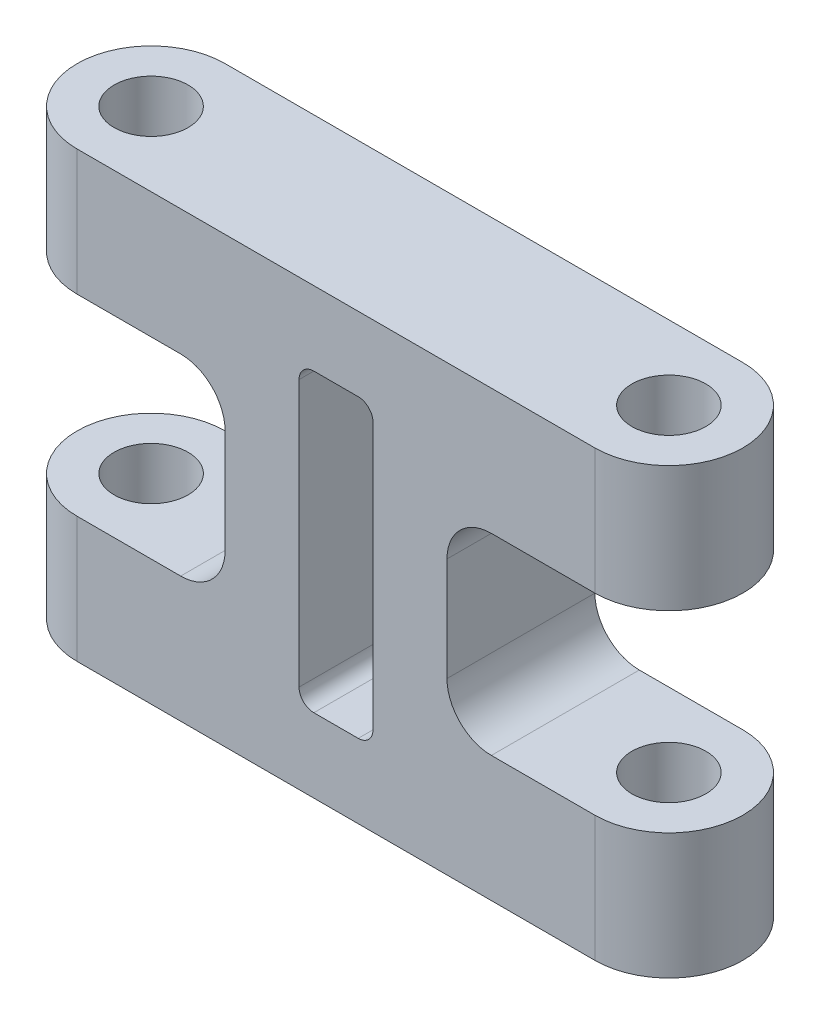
ISO-10303-21;
HEADER;
FILE_DESCRIPTION(('STEP AP214'),'2;1');
FILE_NAME('part.step','',(''),(''),'','','');
FILE_SCHEMA(('AUTOMOTIVE_DESIGN { 1 0 10303 214 1 1 1 1 }'));
ENDSEC;
DATA;
#1=APPLICATION_CONTEXT('core data for automotive mechanical design processes');
#2=APPLICATION_PROTOCOL_DEFINITION('international standard','automotive_design',2000,#1);
#3=PRODUCT_CONTEXT('',#1,'mechanical');
#4=PRODUCT('Part','Part','',(#3));
#5=PRODUCT_RELATED_PRODUCT_CATEGORY('part','',(#4));
#6=PRODUCT_DEFINITION_FORMATION('','',#4);
#7=PRODUCT_DEFINITION_CONTEXT('part definition',#1,'design');
#8=PRODUCT_DEFINITION('design','',#6,#7);
#9=PRODUCT_DEFINITION_SHAPE('','',#8);
#10=(LENGTH_UNIT() NAMED_UNIT(*) SI_UNIT(.MILLI.,.METRE.));
#11=(NAMED_UNIT(*) PLANE_ANGLE_UNIT() SI_UNIT($,.RADIAN.));
#12=(NAMED_UNIT(*) SI_UNIT($,.STERADIAN.) SOLID_ANGLE_UNIT());
#13=UNCERTAINTY_MEASURE_WITH_UNIT(LENGTH_MEASURE(1.E-05),#10,'distance_accuracy_value','');
#14=(GEOMETRIC_REPRESENTATION_CONTEXT(3) GLOBAL_UNCERTAINTY_ASSIGNED_CONTEXT((#13)) GLOBAL_UNIT_ASSIGNED_CONTEXT((#10,
#11,#12)) REPRESENTATION_CONTEXT('',''));
#15=CARTESIAN_POINT('',(0.,0.,0.));
#16=DIRECTION('',(0.,0.,1.));
#17=DIRECTION('',(1.,0.,0.));
#18=AXIS2_PLACEMENT_3D('',#15,#16,#17);
#19=CARTESIAN_POINT('',(-17.5,15.,0.));
#20=DIRECTION('',(0.,-1.,0.));
#21=DIRECTION('',(0.,0.,-1.));
#22=AXIS2_PLACEMENT_3D('',#19,#20,#21);
#23=CYLINDRICAL_SURFACE('',#22,5.);
#24=DIRECTION('',(0.,-1.,0.));
#25=VECTOR('',#24,1.);
#26=CARTESIAN_POINT('',(-17.5,15.,5.));
#27=LINE('',#26,#25);
#28=CARTESIAN_POINT('',(-17.5,-6.50000000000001,5.00000000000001));
#29=VERTEX_POINT('',#28);
#30=CARTESIAN_POINT('',(-17.5,-15.,5.));
#31=VERTEX_POINT('',#30);
#32=EDGE_CURVE('E223',#29,#31,#27,.T.);
#33=ORIENTED_EDGE('',*,*,#32,.F.);
#34=CARTESIAN_POINT('',(-17.5,-6.50000000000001,0.));
#35=DIRECTION('',(0.,-1.,0.));
#36=DIRECTION('',(1.,0.,0.));
#37=AXIS2_PLACEMENT_3D('',#34,#35,#36);
#38=CIRCLE('',#37,5.);
#39=CARTESIAN_POINT('',(-17.5,-6.50000000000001,-5.));
#40=VERTEX_POINT('',#39);
#41=EDGE_CURVE('E338',#29,#40,#38,.T.);
#42=ORIENTED_EDGE('',*,*,#41,.T.);
#43=DIRECTION('',(0.,-1.,0.));
#44=VECTOR('',#43,1.);
#45=CARTESIAN_POINT('',(-17.5,15.,-5.));
#46=LINE('',#45,#44);
#47=CARTESIAN_POINT('',(-17.5,-15.,-5.));
#48=VERTEX_POINT('',#47);
#49=EDGE_CURVE('E352',#40,#48,#46,.T.);
#50=ORIENTED_EDGE('',*,*,#49,.T.);
#51=CARTESIAN_POINT('',(-17.5,-15.,0.));
#52=DIRECTION('',(0.,1.,0.));
#53=DIRECTION('',(0.,0.,1.));
#54=AXIS2_PLACEMENT_3D('',#51,#52,#53);
#55=CIRCLE('',#54,5.);
#56=EDGE_CURVE('E341',#48,#31,#55,.T.);
#57=ORIENTED_EDGE('',*,*,#56,.T.);
#58=EDGE_LOOP('',(#33,#42,#50,#57));
#59=FACE_BOUND('',#58,.T.);
#60=ADVANCED_FACE('F32',(#59),#23,.T.);
#61=CARTESIAN_POINT('',(17.5,15.,0.));
#62=DIRECTION('',(0.,-1.,0.));
#63=DIRECTION('',(0.,0.,-1.));
#64=AXIS2_PLACEMENT_3D('',#61,#62,#63);
#65=CYLINDRICAL_SURFACE('',#64,5.);
#66=DIRECTION('',(0.,-1.,0.));
#67=VECTOR('',#66,1.);
#68=CARTESIAN_POINT('',(17.5,15.,5.));
#69=LINE('',#68,#67);
#70=CARTESIAN_POINT('',(17.5,15.,5.));
#71=VERTEX_POINT('',#70);
#72=CARTESIAN_POINT('',(17.5,6.50000000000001,5.));
#73=VERTEX_POINT('',#72);
#74=EDGE_CURVE('E219',#71,#73,#69,.T.);
#75=ORIENTED_EDGE('',*,*,#74,.T.);
#76=CARTESIAN_POINT('',(17.5,6.5,0.));
#77=DIRECTION('',(0.,1.,0.));
#78=DIRECTION('',(-1.,0.,0.));
#79=AXIS2_PLACEMENT_3D('',#76,#77,#78);
#80=CIRCLE('',#79,5.);
#81=CARTESIAN_POINT('',(17.5,6.50000000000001,-5.00000000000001));
#82=VERTEX_POINT('',#81);
#83=EDGE_CURVE('E202',#73,#82,#80,.T.);
#84=ORIENTED_EDGE('',*,*,#83,.T.);
#85=DIRECTION('',(0.,-1.,0.));
#86=VECTOR('',#85,1.);
#87=CARTESIAN_POINT('',(17.5,15.,-5.00000000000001));
#88=LINE('',#87,#86);
#89=CARTESIAN_POINT('',(17.5,15.,-5.00000000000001));
#90=VERTEX_POINT('',#89);
#91=EDGE_CURVE('E220',#90,#82,#88,.T.);
#92=ORIENTED_EDGE('',*,*,#91,.F.);
#93=CARTESIAN_POINT('',(17.5,15.,0.));
#94=DIRECTION('',(0.,1.,0.));
#95=DIRECTION('',(0.,0.,1.));
#96=AXIS2_PLACEMENT_3D('',#93,#94,#95);
#97=CIRCLE('',#96,5.);
#98=EDGE_CURVE('E348',#71,#90,#97,.T.);
#99=ORIENTED_EDGE('',*,*,#98,.F.);
#100=EDGE_LOOP('',(#75,#84,#92,#99));
#101=FACE_BOUND('',#100,.T.);
#102=ADVANCED_FACE('F388',(#101),#65,.T.);
#103=CARTESIAN_POINT('',(-17.5,6.49999999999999,0.));
#104=DIRECTION('',(0.,1.,0.));
#105=DIRECTION('',(-1.,0.,0.));
#106=AXIS2_PLACEMENT_3D('',#103,#104,#105);
#107=CIRCLE('',#106,5.);
#108=CARTESIAN_POINT('',(-17.5,6.5,-5.));
#109=VERTEX_POINT('',#108);
#110=CARTESIAN_POINT('',(-17.5,6.49999999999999,5.00000000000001));
#111=VERTEX_POINT('',#110);
#112=EDGE_CURVE('E336',#109,#111,#107,.T.);
#113=ORIENTED_EDGE('',*,*,#112,.T.);
#114=CARTESIAN_POINT('',(-17.5,15.,5.));
#115=VERTEX_POINT('',#114);
#116=EDGE_CURVE('E228',#115,#111,#27,.T.);
#117=ORIENTED_EDGE('',*,*,#116,.F.);
#118=CARTESIAN_POINT('',(-17.5,15.,0.));
#119=DIRECTION('',(0.,1.,0.));
#120=DIRECTION('',(0.,0.,1.));
#121=AXIS2_PLACEMENT_3D('',#118,#119,#120);
#122=CIRCLE('',#121,5.);
#123=CARTESIAN_POINT('',(-17.5,15.,-5.));
#124=VERTEX_POINT('',#123);
#125=EDGE_CURVE('E342',#124,#115,#122,.T.);
#126=ORIENTED_EDGE('',*,*,#125,.F.);
#127=EDGE_CURVE('E359',#124,#109,#46,.T.);
#128=ORIENTED_EDGE('',*,*,#127,.T.);
#129=EDGE_LOOP('',(#113,#117,#126,#128));
#130=FACE_BOUND('',#129,.T.);
#131=ADVANCED_FACE('F390',(#130),#23,.T.);
#132=CARTESIAN_POINT('',(-17.5,15.,5.));
#133=DIRECTION('',(0.,0.,-1.));
#134=DIRECTION('',(-1.,0.,0.));
#135=AXIS2_PLACEMENT_3D('',#132,#133,#134);
#136=PLANE('',#135);
#137=DIRECTION('',(-1.,0.,0.));
#138=VECTOR('',#137,1.);
#139=CARTESIAN_POINT('',(-2.5,10.,5.));
#140=LINE('',#139,#138);
#141=CARTESIAN_POINT('',(1.5,10.,5.));
#142=VERTEX_POINT('',#141);
#143=CARTESIAN_POINT('',(-1.5,10.,5.));
#144=VERTEX_POINT('',#143);
#145=EDGE_CURVE('E497',#142,#144,#140,.T.);
#146=ORIENTED_EDGE('',*,*,#145,.F.);
#147=CARTESIAN_POINT('',(1.5,9.,5.));
#148=DIRECTION('',(0.,0.,-1.));
#149=DIRECTION('',(-1.,0.,0.));
#150=AXIS2_PLACEMENT_3D('',#147,#148,#149);
#151=CIRCLE('',#150,1.);
#152=CARTESIAN_POINT('',(2.5,9.,5.));
#153=VERTEX_POINT('',#152);
#154=EDGE_CURVE('E264',#142,#153,#151,.T.);
#155=ORIENTED_EDGE('',*,*,#154,.T.);
#156=DIRECTION('',(0.,1.,0.));
#157=VECTOR('',#156,1.);
#158=CARTESIAN_POINT('',(2.5,-10.,5.));
#159=LINE('',#158,#157);
#160=CARTESIAN_POINT('',(2.5,-9.,5.));
#161=VERTEX_POINT('',#160);
#162=EDGE_CURVE('E494',#161,#153,#159,.T.);
#163=ORIENTED_EDGE('',*,*,#162,.F.);
#164=CARTESIAN_POINT('',(1.5,-9.,5.));
#165=DIRECTION('',(0.,0.,-1.));
#166=DIRECTION('',(-1.,0.,0.));
#167=AXIS2_PLACEMENT_3D('',#164,#165,#166);
#168=CIRCLE('',#167,1.);
#169=CARTESIAN_POINT('',(1.5,-10.,5.));
#170=VERTEX_POINT('',#169);
#171=EDGE_CURVE('E272',#161,#170,#168,.T.);
#172=ORIENTED_EDGE('',*,*,#171,.T.);
#173=DIRECTION('',(1.,0.,0.));
#174=VECTOR('',#173,1.);
#175=CARTESIAN_POINT('',(-2.5,-10.,5.));
#176=LINE('',#175,#174);
#177=CARTESIAN_POINT('',(-1.5,-10.,5.));
#178=VERTEX_POINT('',#177);
#179=EDGE_CURVE('E488',#178,#170,#176,.T.);
#180=ORIENTED_EDGE('',*,*,#179,.F.);
#181=CARTESIAN_POINT('',(-1.5,-9.,5.));
#182=DIRECTION('',(0.,0.,-1.));
#183=DIRECTION('',(-1.,0.,0.));
#184=AXIS2_PLACEMENT_3D('',#181,#182,#183);
#185=CIRCLE('',#184,1.);
#186=CARTESIAN_POINT('',(-2.5,-9.,5.));
#187=VERTEX_POINT('',#186);
#188=EDGE_CURVE('E276',#178,#187,#185,.T.);
#189=ORIENTED_EDGE('',*,*,#188,.T.);
#190=DIRECTION('',(0.,-1.,0.));
#191=VECTOR('',#190,1.);
#192=CARTESIAN_POINT('',(-2.5,-10.,5.));
#193=LINE('',#192,#191);
#194=CARTESIAN_POINT('',(-2.5,9.,5.));
#195=VERTEX_POINT('',#194);
#196=EDGE_CURVE('E499',#195,#187,#193,.T.);
#197=ORIENTED_EDGE('',*,*,#196,.F.);
#198=CARTESIAN_POINT('',(-1.5,9.,5.));
#199=DIRECTION('',(0.,0.,-1.));
#200=DIRECTION('',(-1.,0.,0.));
#201=AXIS2_PLACEMENT_3D('',#198,#199,#200);
#202=CIRCLE('',#201,1.);
#203=EDGE_CURVE('E268',#195,#144,#202,.T.);
#204=ORIENTED_EDGE('',*,*,#203,.T.);
#205=EDGE_LOOP('',(#146,#155,#163,#172,#180,#189,#197,#204));
#206=FACE_BOUND('',#205,.T.);
#207=DIRECTION('',(1.,0.,0.));
#208=VECTOR('',#207,1.);
#209=CARTESIAN_POINT('',(-22.5,6.49999999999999,5.00000000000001));
#210=LINE('',#209,#208);
#211=CARTESIAN_POINT('',(-10.5,6.5,5.00000000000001));
#212=VERTEX_POINT('',#211);
#213=EDGE_CURVE('E408',#111,#212,#210,.T.);
#214=ORIENTED_EDGE('',*,*,#213,.T.);
#215=CARTESIAN_POINT('',(-10.5,3.49999999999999,5.));
#216=DIRECTION('',(0.,0.,-1.));
#217=DIRECTION('',(-1.,0.,0.));
#218=AXIS2_PLACEMENT_3D('',#215,#216,#217);
#219=CIRCLE('',#218,3.);
#220=CARTESIAN_POINT('',(-7.5,3.49999999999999,5.00000000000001));
#221=VERTEX_POINT('',#220);
#222=EDGE_CURVE('E308',#212,#221,#219,.T.);
#223=ORIENTED_EDGE('',*,*,#222,.T.);
#224=DIRECTION('',(0.,-1.,0.));
#225=VECTOR('',#224,1.);
#226=CARTESIAN_POINT('',(-7.5,-6.5,5.00000000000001));
#227=LINE('',#226,#225);
#228=CARTESIAN_POINT('',(-7.5,-3.5,5.00000000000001));
#229=VERTEX_POINT('',#228);
#230=EDGE_CURVE('E412',#221,#229,#227,.T.);
#231=ORIENTED_EDGE('',*,*,#230,.T.);
#232=CARTESIAN_POINT('',(-10.5,-3.5,5.));
#233=DIRECTION('',(0.,0.,-1.));
#234=DIRECTION('',(-1.,0.,0.));
#235=AXIS2_PLACEMENT_3D('',#232,#233,#234);
#236=CIRCLE('',#235,3.);
#237=CARTESIAN_POINT('',(-10.5,-6.5,5.00000000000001));
#238=VERTEX_POINT('',#237);
#239=EDGE_CURVE('E304',#229,#238,#236,.T.);
#240=ORIENTED_EDGE('',*,*,#239,.T.);
#241=DIRECTION('',(-1.,0.,0.));
#242=VECTOR('',#241,1.);
#243=CARTESIAN_POINT('',(-22.5,-6.50000000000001,5.00000000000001));
#244=LINE('',#243,#242);
#245=EDGE_CURVE('E203',#238,#29,#244,.T.);
#246=ORIENTED_EDGE('',*,*,#245,.T.);
#247=ORIENTED_EDGE('',*,*,#32,.T.);
#248=DIRECTION('',(1.,0.,0.));
#249=VECTOR('',#248,1.);
#250=CARTESIAN_POINT('',(-17.5,-15.,5.));
#251=LINE('',#250,#249);
#252=CARTESIAN_POINT('',(17.5,-15.,5.));
#253=VERTEX_POINT('',#252);
#254=EDGE_CURVE('E217',#31,#253,#251,.T.);
#255=ORIENTED_EDGE('',*,*,#254,.T.);
#256=CARTESIAN_POINT('',(17.5,-6.49999999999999,5.));
#257=VERTEX_POINT('',#256);
#258=EDGE_CURVE('E197',#257,#253,#69,.T.);
#259=ORIENTED_EDGE('',*,*,#258,.F.);
#260=DIRECTION('',(-1.,0.,0.));
#261=VECTOR('',#260,1.);
#262=CARTESIAN_POINT('',(22.5,-6.49999999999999,5.));
#263=LINE('',#262,#261);
#264=CARTESIAN_POINT('',(10.5,-6.5,5.));
#265=VERTEX_POINT('',#264);
#266=EDGE_CURVE('E206',#257,#265,#263,.T.);
#267=ORIENTED_EDGE('',*,*,#266,.T.);
#268=CARTESIAN_POINT('',(10.5,-3.5,5.));
#269=DIRECTION('',(0.,0.,-1.));
#270=DIRECTION('',(-1.,0.,0.));
#271=AXIS2_PLACEMENT_3D('',#268,#269,#270);
#272=CIRCLE('',#271,3.);
#273=CARTESIAN_POINT('',(7.5,-3.5,5.));
#274=VERTEX_POINT('',#273);
#275=EDGE_CURVE('E300',#265,#274,#272,.T.);
#276=ORIENTED_EDGE('',*,*,#275,.T.);
#277=DIRECTION('',(0.,1.,0.));
#278=VECTOR('',#277,1.);
#279=CARTESIAN_POINT('',(7.5,-6.5,5.));
#280=LINE('',#279,#278);
#281=CARTESIAN_POINT('',(7.5,3.5,5.00000000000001));
#282=VERTEX_POINT('',#281);
#283=EDGE_CURVE('E211',#274,#282,#280,.T.);
#284=ORIENTED_EDGE('',*,*,#283,.T.);
#285=CARTESIAN_POINT('',(10.5,3.5,5.));
#286=DIRECTION('',(0.,0.,-1.));
#287=DIRECTION('',(-1.,0.,0.));
#288=AXIS2_PLACEMENT_3D('',#285,#286,#287);
#289=CIRCLE('',#288,3.);
#290=CARTESIAN_POINT('',(10.5,6.5,5.));
#291=VERTEX_POINT('',#290);
#292=EDGE_CURVE('E11',#282,#291,#289,.T.);
#293=ORIENTED_EDGE('',*,*,#292,.T.);
#294=DIRECTION('',(1.,0.,0.));
#295=VECTOR('',#294,1.);
#296=CARTESIAN_POINT('',(22.5,6.50000000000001,5.));
#297=LINE('',#296,#295);
#298=EDGE_CURVE('E325',#291,#73,#297,.T.);
#299=ORIENTED_EDGE('',*,*,#298,.T.);
#300=ORIENTED_EDGE('',*,*,#74,.F.);
#301=DIRECTION('',(1.,0.,0.));
#302=VECTOR('',#301,1.);
#303=CARTESIAN_POINT('',(-17.5,15.,5.));
#304=LINE('',#303,#302);
#305=EDGE_CURVE('E345',#115,#71,#304,.T.);
#306=ORIENTED_EDGE('',*,*,#305,.F.);
#307=ORIENTED_EDGE('',*,*,#116,.T.);
#308=EDGE_LOOP('',(#214,#223,#231,#240,#246,#247,#255,#259,#267,#276,#284,#293,#299,#300,#306,#307));
#309=FACE_BOUND('',#308,.T.);
#310=ADVANCED_FACE('F215',(#206,#309),#136,.F.);
#311=CARTESIAN_POINT('',(17.5,-6.5,0.));
#312=DIRECTION('',(0.,-1.,0.));
#313=DIRECTION('',(1.,0.,0.));
#314=AXIS2_PLACEMENT_3D('',#311,#312,#313);
#315=CIRCLE('',#314,5.);
#316=CARTESIAN_POINT('',(17.5,-6.5,-5.00000000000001));
#317=VERTEX_POINT('',#316);
#318=EDGE_CURVE('E192',#317,#257,#315,.T.);
#319=ORIENTED_EDGE('',*,*,#318,.T.);
#320=ORIENTED_EDGE('',*,*,#258,.T.);
#321=CARTESIAN_POINT('',(17.5,-15.,0.));
#322=DIRECTION('',(0.,1.,0.));
#323=DIRECTION('',(0.,0.,1.));
#324=AXIS2_PLACEMENT_3D('',#321,#322,#323);
#325=CIRCLE('',#324,5.);
#326=CARTESIAN_POINT('',(17.5,-15.,-5.00000000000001));
#327=VERTEX_POINT('',#326);
#328=EDGE_CURVE('E356',#253,#327,#325,.T.);
#329=ORIENTED_EDGE('',*,*,#328,.T.);
#330=EDGE_CURVE('E199',#317,#327,#88,.T.);
#331=ORIENTED_EDGE('',*,*,#330,.F.);
#332=EDGE_LOOP('',(#319,#320,#329,#331));
#333=FACE_BOUND('',#332,.T.);
#334=ADVANCED_FACE('F194',(#333),#65,.T.);
#335=CARTESIAN_POINT('',(-17.5,15.,-5.));
#336=DIRECTION('',(0.,0.,1.));
#337=DIRECTION('',(1.,0.,0.));
#338=AXIS2_PLACEMENT_3D('',#335,#336,#337);
#339=PLANE('',#338);
#340=DIRECTION('',(0.,-1.,0.));
#341=VECTOR('',#340,1.);
#342=CARTESIAN_POINT('',(-2.5,-10.,-5.00000000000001));
#343=LINE('',#342,#341);
#344=CARTESIAN_POINT('',(-2.5,9.,-5.00000000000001));
#345=VERTEX_POINT('',#344);
#346=CARTESIAN_POINT('',(-2.5,-9.,-5.00000000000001));
#347=VERTEX_POINT('',#346);
#348=EDGE_CURVE('E484',#345,#347,#343,.T.);
#349=ORIENTED_EDGE('',*,*,#348,.T.);
#350=CARTESIAN_POINT('',(-1.5,-9.,-5.));
#351=DIRECTION('',(0.,0.,1.));
#352=DIRECTION('',(1.,0.,0.));
#353=AXIS2_PLACEMENT_3D('',#350,#351,#352);
#354=CIRCLE('',#353,1.);
#355=CARTESIAN_POINT('',(-1.5,-10.,-5.00000000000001));
#356=VERTEX_POINT('',#355);
#357=EDGE_CURVE('E278',#347,#356,#354,.T.);
#358=ORIENTED_EDGE('',*,*,#357,.T.);
#359=DIRECTION('',(1.,0.,0.));
#360=VECTOR('',#359,1.);
#361=CARTESIAN_POINT('',(-2.5,-10.,-5.00000000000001));
#362=LINE('',#361,#360);
#363=CARTESIAN_POINT('',(1.5,-10.,-5.00000000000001));
#364=VERTEX_POINT('',#363);
#365=EDGE_CURVE('E486',#356,#364,#362,.T.);
#366=ORIENTED_EDGE('',*,*,#365,.T.);
#367=CARTESIAN_POINT('',(1.5,-9.,-5.));
#368=DIRECTION('',(0.,0.,1.));
#369=DIRECTION('',(1.,0.,0.));
#370=AXIS2_PLACEMENT_3D('',#367,#368,#369);
#371=CIRCLE('',#370,1.);
#372=CARTESIAN_POINT('',(2.5,-9.,-5.00000000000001));
#373=VERTEX_POINT('',#372);
#374=EDGE_CURVE('E274',#364,#373,#371,.T.);
#375=ORIENTED_EDGE('',*,*,#374,.T.);
#376=DIRECTION('',(0.,1.,0.));
#377=VECTOR('',#376,1.);
#378=CARTESIAN_POINT('',(2.5,-10.,-5.00000000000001));
#379=LINE('',#378,#377);
#380=CARTESIAN_POINT('',(2.5,9.,-5.00000000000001));
#381=VERTEX_POINT('',#380);
#382=EDGE_CURVE('E480',#373,#381,#379,.T.);
#383=ORIENTED_EDGE('',*,*,#382,.T.);
#384=CARTESIAN_POINT('',(1.5,9.,-5.));
#385=DIRECTION('',(0.,0.,1.));
#386=DIRECTION('',(1.,0.,0.));
#387=AXIS2_PLACEMENT_3D('',#384,#385,#386);
#388=CIRCLE('',#387,1.);
#389=CARTESIAN_POINT('',(1.5,10.,-5.00000000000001));
#390=VERTEX_POINT('',#389);
#391=EDGE_CURVE('E266',#381,#390,#388,.T.);
#392=ORIENTED_EDGE('',*,*,#391,.T.);
#393=DIRECTION('',(-1.,0.,0.));
#394=VECTOR('',#393,1.);
#395=CARTESIAN_POINT('',(-2.5,10.,-5.00000000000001));
#396=LINE('',#395,#394);
#397=CARTESIAN_POINT('',(-1.5,10.,-5.00000000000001));
#398=VERTEX_POINT('',#397);
#399=EDGE_CURVE('E477',#390,#398,#396,.T.);
#400=ORIENTED_EDGE('',*,*,#399,.T.);
#401=CARTESIAN_POINT('',(-1.5,9.,-5.));
#402=DIRECTION('',(0.,0.,1.));
#403=DIRECTION('',(1.,0.,0.));
#404=AXIS2_PLACEMENT_3D('',#401,#402,#403);
#405=CIRCLE('',#404,1.);
#406=EDGE_CURVE('E270',#398,#345,#405,.T.);
#407=ORIENTED_EDGE('',*,*,#406,.T.);
#408=EDGE_LOOP('',(#349,#358,#366,#375,#383,#392,#400,#407));
#409=FACE_BOUND('',#408,.T.);
#410=ORIENTED_EDGE('',*,*,#49,.F.);
#411=DIRECTION('',(-1.,0.,0.));
#412=VECTOR('',#411,1.);
#413=CARTESIAN_POINT('',(-22.5,-6.50000000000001,-5.));
#414=LINE('',#413,#412);
#415=CARTESIAN_POINT('',(-10.5,-6.5,-5.));
#416=VERTEX_POINT('',#415);
#417=EDGE_CURVE('E330',#416,#40,#414,.T.);
#418=ORIENTED_EDGE('',*,*,#417,.F.);
#419=CARTESIAN_POINT('',(-10.5,-3.5,-5.));
#420=DIRECTION('',(0.,0.,1.));
#421=DIRECTION('',(1.,0.,0.));
#422=AXIS2_PLACEMENT_3D('',#419,#420,#421);
#423=CIRCLE('',#422,3.);
#424=CARTESIAN_POINT('',(-7.5,-3.5,-5.));
#425=VERTEX_POINT('',#424);
#426=EDGE_CURVE('E302',#416,#425,#423,.T.);
#427=ORIENTED_EDGE('',*,*,#426,.T.);
#428=DIRECTION('',(0.,-1.,0.));
#429=VECTOR('',#428,1.);
#430=CARTESIAN_POINT('',(-7.5,-6.5,-5.));
#431=LINE('',#430,#429);
#432=CARTESIAN_POINT('',(-7.5,3.49999999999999,-5.));
#433=VERTEX_POINT('',#432);
#434=EDGE_CURVE('E327',#433,#425,#431,.T.);
#435=ORIENTED_EDGE('',*,*,#434,.F.);
#436=CARTESIAN_POINT('',(-10.5,3.49999999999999,-5.));
#437=DIRECTION('',(0.,0.,1.));
#438=DIRECTION('',(1.,0.,0.));
#439=AXIS2_PLACEMENT_3D('',#436,#437,#438);
#440=CIRCLE('',#439,3.);
#441=CARTESIAN_POINT('',(-10.5,6.5,-5.));
#442=VERTEX_POINT('',#441);
#443=EDGE_CURVE('E306',#433,#442,#440,.T.);
#444=ORIENTED_EDGE('',*,*,#443,.T.);
#445=DIRECTION('',(-1.,0.,0.));
#446=VECTOR('',#445,1.);
#447=CARTESIAN_POINT('',(-17.5,6.49999999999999,-5.));
#448=LINE('',#447,#446);
#449=EDGE_CURVE('E233',#442,#109,#448,.T.);
#450=ORIENTED_EDGE('',*,*,#449,.T.);
#451=ORIENTED_EDGE('',*,*,#127,.F.);
#452=DIRECTION('',(-1.,0.,0.));
#453=VECTOR('',#452,1.);
#454=CARTESIAN_POINT('',(-17.5,15.,-5.));
#455=LINE('',#454,#453);
#456=EDGE_CURVE('E350',#90,#124,#455,.T.);
#457=ORIENTED_EDGE('',*,*,#456,.F.);
#458=ORIENTED_EDGE('',*,*,#91,.T.);
#459=DIRECTION('',(1.,0.,0.));
#460=VECTOR('',#459,1.);
#461=CARTESIAN_POINT('',(22.5,6.50000000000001,-5.00000000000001));
#462=LINE('',#461,#460);
#463=CARTESIAN_POINT('',(10.5,6.5,-5.00000000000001));
#464=VERTEX_POINT('',#463);
#465=EDGE_CURVE('E212',#464,#82,#462,.T.);
#466=ORIENTED_EDGE('',*,*,#465,.F.);
#467=CARTESIAN_POINT('',(10.5,3.5,-5.00000000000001));
#468=DIRECTION('',(0.,0.,1.));
#469=DIRECTION('',(1.,0.,0.));
#470=AXIS2_PLACEMENT_3D('',#467,#468,#469);
#471=CIRCLE('',#470,3.);
#472=CARTESIAN_POINT('',(7.5,3.5,-5.00000000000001));
#473=VERTEX_POINT('',#472);
#474=EDGE_CURVE('E40',#464,#473,#471,.T.);
#475=ORIENTED_EDGE('',*,*,#474,.T.);
#476=DIRECTION('',(0.,1.,0.));
#477=VECTOR('',#476,1.);
#478=CARTESIAN_POINT('',(7.5,-6.5,-5.00000000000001));
#479=LINE('',#478,#477);
#480=CARTESIAN_POINT('',(7.5,-3.5,-5.00000000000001));
#481=VERTEX_POINT('',#480);
#482=EDGE_CURVE('E315',#481,#473,#479,.T.);
#483=ORIENTED_EDGE('',*,*,#482,.F.);
#484=CARTESIAN_POINT('',(10.5,-3.5,-5.00000000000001));
#485=DIRECTION('',(0.,0.,1.));
#486=DIRECTION('',(1.,0.,0.));
#487=AXIS2_PLACEMENT_3D('',#484,#485,#486);
#488=CIRCLE('',#487,3.);
#489=CARTESIAN_POINT('',(10.5,-6.5,-5.00000000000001));
#490=VERTEX_POINT('',#489);
#491=EDGE_CURVE('E298',#481,#490,#488,.T.);
#492=ORIENTED_EDGE('',*,*,#491,.T.);
#493=DIRECTION('',(1.,0.,0.));
#494=VECTOR('',#493,1.);
#495=CARTESIAN_POINT('',(-17.5,-6.50000000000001,-5.));
#496=LINE('',#495,#494);
#497=EDGE_CURVE('E231',#490,#317,#496,.T.);
#498=ORIENTED_EDGE('',*,*,#497,.T.);
#499=ORIENTED_EDGE('',*,*,#330,.T.);
#500=DIRECTION('',(-1.,0.,0.));
#501=VECTOR('',#500,1.);
#502=CARTESIAN_POINT('',(-17.5,-15.,-5.));
#503=LINE('',#502,#501);
#504=EDGE_CURVE('E346',#327,#48,#503,.T.);
#505=ORIENTED_EDGE('',*,*,#504,.T.);
#506=EDGE_LOOP('',(#410,#418,#427,#435,#444,#450,#451,#457,#458,#466,#475,#483,#492,#498,#499,#505));
#507=FACE_BOUND('',#506,.T.);
#508=ADVANCED_FACE('F314',(#409,#507),#339,.F.);
#509=CARTESIAN_POINT('',(-17.5,15.,0.));
#510=DIRECTION('',(0.,1.,0.));
#511=DIRECTION('',(0.,0.,1.));
#512=AXIS2_PLACEMENT_3D('',#509,#510,#511);
#513=PLANE('',#512);
#514=CARTESIAN_POINT('',(-17.5,15.,0.));
#515=DIRECTION('',(0.,1.,0.));
#516=DIRECTION('',(0.,0.,1.));
#517=AXIS2_PLACEMENT_3D('',#514,#515,#516);
#518=CIRCLE('',#517,2.5);
#519=CARTESIAN_POINT('',(-17.5,15.,2.5));
#520=VERTEX_POINT('',#519);
#521=EDGE_CURVE('E505',#520,#520,#518,.T.);
#522=ORIENTED_EDGE('',*,*,#521,.F.);
#523=EDGE_LOOP('',(#522));
#524=FACE_BOUND('',#523,.T.);
#525=CARTESIAN_POINT('',(17.5,15.,0.));
#526=DIRECTION('',(0.,1.,0.));
#527=DIRECTION('',(0.,0.,1.));
#528=AXIS2_PLACEMENT_3D('',#525,#526,#527);
#529=CIRCLE('',#528,2.5);
#530=CARTESIAN_POINT('',(17.5,15.,2.5));
#531=VERTEX_POINT('',#530);
#532=EDGE_CURVE('E493',#531,#531,#529,.T.);
#533=ORIENTED_EDGE('',*,*,#532,.F.);
#534=EDGE_LOOP('',(#533));
#535=FACE_BOUND('',#534,.T.);
#536=ORIENTED_EDGE('',*,*,#125,.T.);
#537=ORIENTED_EDGE('',*,*,#305,.T.);
#538=ORIENTED_EDGE('',*,*,#98,.T.);
#539=ORIENTED_EDGE('',*,*,#456,.T.);
#540=EDGE_LOOP('',(#536,#537,#538,#539));
#541=FACE_BOUND('',#540,.T.);
#542=ADVANCED_FACE('F373',(#524,#535,#541),#513,.T.);
#543=CARTESIAN_POINT('',(-17.5,-15.,0.));
#544=DIRECTION('',(0.,1.,0.));
#545=DIRECTION('',(0.,0.,1.));
#546=AXIS2_PLACEMENT_3D('',#543,#544,#545);
#547=PLANE('',#546);
#548=CARTESIAN_POINT('',(-17.5,-15.,0.));
#549=DIRECTION('',(0.,1.,0.));
#550=DIRECTION('',(0.,0.,1.));
#551=AXIS2_PLACEMENT_3D('',#548,#549,#550);
#552=CIRCLE('',#551,2.5);
#553=CARTESIAN_POINT('',(-17.5,-15.,2.5));
#554=VERTEX_POINT('',#553);
#555=EDGE_CURVE('E240',#554,#554,#552,.T.);
#556=ORIENTED_EDGE('',*,*,#555,.T.);
#557=EDGE_LOOP('',(#556));
#558=FACE_BOUND('',#557,.T.);
#559=CARTESIAN_POINT('',(17.5,-15.,0.));
#560=DIRECTION('',(0.,1.,0.));
#561=DIRECTION('',(0.,0.,1.));
#562=AXIS2_PLACEMENT_3D('',#559,#560,#561);
#563=CIRCLE('',#562,2.5);
#564=CARTESIAN_POINT('',(17.5,-15.,2.5));
#565=VERTEX_POINT('',#564);
#566=EDGE_CURVE('E508',#565,#565,#563,.T.);
#567=ORIENTED_EDGE('',*,*,#566,.T.);
#568=EDGE_LOOP('',(#567));
#569=FACE_BOUND('',#568,.T.);
#570=ORIENTED_EDGE('',*,*,#56,.F.);
#571=ORIENTED_EDGE('',*,*,#504,.F.);
#572=ORIENTED_EDGE('',*,*,#328,.F.);
#573=ORIENTED_EDGE('',*,*,#254,.F.);
#574=EDGE_LOOP('',(#570,#571,#572,#573));
#575=FACE_BOUND('',#574,.T.);
#576=ADVANCED_FACE('F371',(#558,#569,#575),#547,.F.);
#577=CARTESIAN_POINT('',(22.5,6.50000000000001,5.));
#578=DIRECTION('',(0.,1.,0.));
#579=DIRECTION('',(-1.,0.,0.));
#580=AXIS2_PLACEMENT_3D('',#577,#578,#579);
#581=PLANE('',#580);
#582=CARTESIAN_POINT('',(17.5,6.50000000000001,0.));
#583=DIRECTION('',(0.,1.,0.));
#584=DIRECTION('',(-1.,0.,0.));
#585=AXIS2_PLACEMENT_3D('',#582,#583,#584);
#586=CIRCLE('',#585,2.5);
#587=CARTESIAN_POINT('',(15.,6.50000000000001,0.));
#588=VERTEX_POINT('',#587);
#589=EDGE_CURVE('E244',#588,#588,#586,.T.);
#590=ORIENTED_EDGE('',*,*,#589,.T.);
#591=EDGE_LOOP('',(#590));
#592=FACE_BOUND('',#591,.T.);
#593=ORIENTED_EDGE('',*,*,#298,.F.);
#594=DIRECTION('',(0.,0.,-1.));
#595=VECTOR('',#594,1.);
#596=CARTESIAN_POINT('',(10.5,6.5,-5.));
#597=LINE('',#596,#595);
#598=EDGE_CURVE('E296',#291,#464,#597,.T.);
#599=ORIENTED_EDGE('',*,*,#598,.T.);
#600=ORIENTED_EDGE('',*,*,#465,.T.);
#601=ORIENTED_EDGE('',*,*,#83,.F.);
#602=EDGE_LOOP('',(#593,#599,#600,#601));
#603=FACE_BOUND('',#602,.T.);
#604=ADVANCED_FACE('F322',(#592,#603),#581,.F.);
#605=CARTESIAN_POINT('',(22.5,-6.49999999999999,5.));
#606=DIRECTION('',(0.,-1.,0.));
#607=DIRECTION('',(1.,0.,0.));
#608=AXIS2_PLACEMENT_3D('',#605,#606,#607);
#609=PLANE('',#608);
#610=CARTESIAN_POINT('',(17.5,-6.49999999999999,0.));
#611=DIRECTION('',(0.,-1.,0.));
#612=DIRECTION('',(1.,0.,0.));
#613=AXIS2_PLACEMENT_3D('',#610,#611,#612);
#614=CIRCLE('',#613,2.5);
#615=CARTESIAN_POINT('',(20.,-6.49999999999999,0.));
#616=VERTEX_POINT('',#615);
#617=EDGE_CURVE('E241',#616,#616,#614,.T.);
#618=ORIENTED_EDGE('',*,*,#617,.T.);
#619=EDGE_LOOP('',(#618));
#620=FACE_BOUND('',#619,.T.);
#621=ORIENTED_EDGE('',*,*,#497,.F.);
#622=DIRECTION('',(0.,0.,-1.));
#623=VECTOR('',#622,1.);
#624=CARTESIAN_POINT('',(10.5,-6.5,5.));
#625=LINE('',#624,#623);
#626=EDGE_CURVE('E209',#490,#265,#625,.F.);
#627=ORIENTED_EDGE('',*,*,#626,.T.);
#628=ORIENTED_EDGE('',*,*,#266,.F.);
#629=ORIENTED_EDGE('',*,*,#318,.F.);
#630=EDGE_LOOP('',(#621,#627,#628,#629));
#631=FACE_BOUND('',#630,.T.);
#632=ADVANCED_FACE('F207',(#620,#631),#609,.F.);
#633=CARTESIAN_POINT('',(7.5,-6.5,5.));
#634=DIRECTION('',(-1.,0.,0.));
#635=DIRECTION('',(0.,-1.,0.));
#636=AXIS2_PLACEMENT_3D('',#633,#634,#635);
#637=PLANE('',#636);
#638=ORIENTED_EDGE('',*,*,#283,.F.);
#639=DIRECTION('',(0.,0.,-1.));
#640=VECTOR('',#639,1.);
#641=CARTESIAN_POINT('',(7.5,-3.5,-5.));
#642=LINE('',#641,#640);
#643=EDGE_CURVE('E282',#274,#481,#642,.T.);
#644=ORIENTED_EDGE('',*,*,#643,.T.);
#645=ORIENTED_EDGE('',*,*,#482,.T.);
#646=DIRECTION('',(0.,0.,-1.));
#647=VECTOR('',#646,1.);
#648=CARTESIAN_POINT('',(7.5,3.5,5.00000000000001));
#649=LINE('',#648,#647);
#650=EDGE_CURVE('E280',#473,#282,#649,.F.);
#651=ORIENTED_EDGE('',*,*,#650,.T.);
#652=EDGE_LOOP('',(#638,#644,#645,#651));
#653=FACE_BOUND('',#652,.T.);
#654=ADVANCED_FACE('F318',(#653),#637,.F.);
#655=CARTESIAN_POINT('',(-22.5,-6.50000000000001,5.00000000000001));
#656=DIRECTION('',(0.,-1.,0.));
#657=DIRECTION('',(1.,0.,0.));
#658=AXIS2_PLACEMENT_3D('',#655,#656,#657);
#659=PLANE('',#658);
#660=CARTESIAN_POINT('',(-17.5,-6.50000000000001,0.));
#661=DIRECTION('',(0.,-1.,0.));
#662=DIRECTION('',(1.,0.,0.));
#663=AXIS2_PLACEMENT_3D('',#660,#661,#662);
#664=CIRCLE('',#663,2.5);
#665=CARTESIAN_POINT('',(-15.,-6.50000000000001,0.));
#666=VERTEX_POINT('',#665);
#667=EDGE_CURVE('E239',#666,#666,#664,.T.);
#668=ORIENTED_EDGE('',*,*,#667,.T.);
#669=EDGE_LOOP('',(#668));
#670=FACE_BOUND('',#669,.T.);
#671=ORIENTED_EDGE('',*,*,#245,.F.);
#672=DIRECTION('',(0.,0.,-1.));
#673=VECTOR('',#672,1.);
#674=CARTESIAN_POINT('',(-10.5,-6.5,-5.));
#675=LINE('',#674,#673);
#676=EDGE_CURVE('E286',#238,#416,#675,.T.);
#677=ORIENTED_EDGE('',*,*,#676,.T.);
#678=ORIENTED_EDGE('',*,*,#417,.T.);
#679=ORIENTED_EDGE('',*,*,#41,.F.);
#680=EDGE_LOOP('',(#671,#677,#678,#679));
#681=FACE_BOUND('',#680,.T.);
#682=ADVANCED_FACE('F434',(#670,#681),#659,.F.);
#683=CARTESIAN_POINT('',(-22.5,6.49999999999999,5.00000000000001));
#684=DIRECTION('',(0.,1.,0.));
#685=DIRECTION('',(-1.,0.,0.));
#686=AXIS2_PLACEMENT_3D('',#683,#684,#685);
#687=PLANE('',#686);
#688=CARTESIAN_POINT('',(-17.5,6.49999999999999,0.));
#689=DIRECTION('',(0.,1.,0.));
#690=DIRECTION('',(-1.,0.,0.));
#691=AXIS2_PLACEMENT_3D('',#688,#689,#690);
#692=CIRCLE('',#691,2.5);
#693=CARTESIAN_POINT('',(-20.,6.49999999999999,0.));
#694=VERTEX_POINT('',#693);
#695=EDGE_CURVE('E236',#694,#694,#692,.T.);
#696=ORIENTED_EDGE('',*,*,#695,.T.);
#697=EDGE_LOOP('',(#696));
#698=FACE_BOUND('',#697,.T.);
#699=ORIENTED_EDGE('',*,*,#449,.F.);
#700=DIRECTION('',(0.,0.,-1.));
#701=VECTOR('',#700,1.);
#702=CARTESIAN_POINT('',(-10.5,6.5,5.00000000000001));
#703=LINE('',#702,#701);
#704=EDGE_CURVE('E294',#442,#212,#703,.F.);
#705=ORIENTED_EDGE('',*,*,#704,.T.);
#706=ORIENTED_EDGE('',*,*,#213,.F.);
#707=ORIENTED_EDGE('',*,*,#112,.F.);
#708=EDGE_LOOP('',(#699,#705,#706,#707));
#709=FACE_BOUND('',#708,.T.);
#710=ADVANCED_FACE('F409',(#698,#709),#687,.F.);
#711=CARTESIAN_POINT('',(-7.5,-6.5,5.00000000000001));
#712=DIRECTION('',(1.,0.,0.));
#713=DIRECTION('',(0.,1.,0.));
#714=AXIS2_PLACEMENT_3D('',#711,#712,#713);
#715=PLANE('',#714);
#716=ORIENTED_EDGE('',*,*,#434,.T.);
#717=DIRECTION('',(0.,0.,-1.));
#718=VECTOR('',#717,1.);
#719=CARTESIAN_POINT('',(-7.5,-3.5,5.00000000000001));
#720=LINE('',#719,#718);
#721=EDGE_CURVE('E292',#425,#229,#720,.F.);
#722=ORIENTED_EDGE('',*,*,#721,.T.);
#723=ORIENTED_EDGE('',*,*,#230,.F.);
#724=DIRECTION('',(0.,0.,-1.));
#725=VECTOR('',#724,1.);
#726=CARTESIAN_POINT('',(-7.5,3.5,-5.));
#727=LINE('',#726,#725);
#728=EDGE_CURVE('E289',#221,#433,#727,.T.);
#729=ORIENTED_EDGE('',*,*,#728,.T.);
#730=EDGE_LOOP('',(#716,#722,#723,#729));
#731=FACE_BOUND('',#730,.T.);
#732=ADVANCED_FACE('F426',(#731),#715,.F.);
#733=CARTESIAN_POINT('',(-17.5,-15.,0.));
#734=DIRECTION('',(0.,1.,0.));
#735=DIRECTION('',(0.,0.,1.));
#736=AXIS2_PLACEMENT_3D('',#733,#734,#735);
#737=CYLINDRICAL_SURFACE('',#736,2.5);
#738=ORIENTED_EDGE('',*,*,#521,.T.);
#739=EDGE_LOOP('',(#738));
#740=FACE_BOUND('',#739,.T.);
#741=ORIENTED_EDGE('',*,*,#695,.F.);
#742=EDGE_LOOP('',(#741));
#743=FACE_BOUND('',#742,.T.);
#744=ADVANCED_FACE('F539',(#740,#743),#737,.F.);
#745=ORIENTED_EDGE('',*,*,#555,.F.);
#746=EDGE_LOOP('',(#745));
#747=FACE_BOUND('',#746,.T.);
#748=ORIENTED_EDGE('',*,*,#667,.F.);
#749=EDGE_LOOP('',(#748));
#750=FACE_BOUND('',#749,.T.);
#751=ADVANCED_FACE('F530',(#747,#750),#737,.F.);
#752=CARTESIAN_POINT('',(17.5,-15.,0.));
#753=DIRECTION('',(0.,1.,0.));
#754=DIRECTION('',(0.,0.,1.));
#755=AXIS2_PLACEMENT_3D('',#752,#753,#754);
#756=CYLINDRICAL_SURFACE('',#755,2.5);
#757=ORIENTED_EDGE('',*,*,#566,.F.);
#758=EDGE_LOOP('',(#757));
#759=FACE_BOUND('',#758,.T.);
#760=ORIENTED_EDGE('',*,*,#617,.F.);
#761=EDGE_LOOP('',(#760));
#762=FACE_BOUND('',#761,.T.);
#763=ADVANCED_FACE('F520',(#759,#762),#756,.F.);
#764=ORIENTED_EDGE('',*,*,#532,.T.);
#765=EDGE_LOOP('',(#764));
#766=FACE_BOUND('',#765,.T.);
#767=ORIENTED_EDGE('',*,*,#589,.F.);
#768=EDGE_LOOP('',(#767));
#769=FACE_BOUND('',#768,.T.);
#770=ADVANCED_FACE('F517',(#766,#769),#756,.F.);
#771=CARTESIAN_POINT('',(2.5,-10.,-5.00000000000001));
#772=DIRECTION('',(1.,0.,0.));
#773=DIRECTION('',(0.,0.,-1.));
#774=AXIS2_PLACEMENT_3D('',#771,#772,#773);
#775=PLANE('',#774);
#776=ORIENTED_EDGE('',*,*,#162,.T.);
#777=DIRECTION('',(0.,0.,1.));
#778=VECTOR('',#777,1.);
#779=CARTESIAN_POINT('',(2.5,9.,-5.00000000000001));
#780=LINE('',#779,#778);
#781=EDGE_CURVE('E252',#153,#381,#780,.F.);
#782=ORIENTED_EDGE('',*,*,#781,.T.);
#783=ORIENTED_EDGE('',*,*,#382,.F.);
#784=DIRECTION('',(0.,0.,1.));
#785=VECTOR('',#784,1.);
#786=CARTESIAN_POINT('',(2.5,-9.,5.));
#787=LINE('',#786,#785);
#788=EDGE_CURVE('E249',#373,#161,#787,.T.);
#789=ORIENTED_EDGE('',*,*,#788,.T.);
#790=EDGE_LOOP('',(#776,#782,#783,#789));
#791=FACE_BOUND('',#790,.T.);
#792=ADVANCED_FACE('F519',(#791),#775,.F.);
#793=CARTESIAN_POINT('',(-2.5,-10.,-5.00000000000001));
#794=DIRECTION('',(0.,-1.,0.));
#795=DIRECTION('',(0.,0.,-1.));
#796=AXIS2_PLACEMENT_3D('',#793,#794,#795);
#797=PLANE('',#796);
#798=ORIENTED_EDGE('',*,*,#179,.T.);
#799=DIRECTION('',(0.,0.,1.));
#800=VECTOR('',#799,1.);
#801=CARTESIAN_POINT('',(1.5,-10.,-5.00000000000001));
#802=LINE('',#801,#800);
#803=EDGE_CURVE('E262',#170,#364,#802,.F.);
#804=ORIENTED_EDGE('',*,*,#803,.T.);
#805=ORIENTED_EDGE('',*,*,#365,.F.);
#806=DIRECTION('',(0.,0.,1.));
#807=VECTOR('',#806,1.);
#808=CARTESIAN_POINT('',(-1.5,-10.,5.));
#809=LINE('',#808,#807);
#810=EDGE_CURVE('E259',#356,#178,#809,.T.);
#811=ORIENTED_EDGE('',*,*,#810,.T.);
#812=EDGE_LOOP('',(#798,#804,#805,#811));
#813=FACE_BOUND('',#812,.T.);
#814=ADVANCED_FACE('F527',(#813),#797,.F.);
#815=CARTESIAN_POINT('',(-2.5,-10.,-5.00000000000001));
#816=DIRECTION('',(-1.,0.,0.));
#817=DIRECTION('',(0.,0.,1.));
#818=AXIS2_PLACEMENT_3D('',#815,#816,#817);
#819=PLANE('',#818);
#820=ORIENTED_EDGE('',*,*,#348,.F.);
#821=DIRECTION('',(0.,0.,1.));
#822=VECTOR('',#821,1.);
#823=CARTESIAN_POINT('',(-2.5,9.,5.));
#824=LINE('',#823,#822);
#825=EDGE_CURVE('E256',#345,#195,#824,.T.);
#826=ORIENTED_EDGE('',*,*,#825,.T.);
#827=ORIENTED_EDGE('',*,*,#196,.T.);
#828=DIRECTION('',(0.,0.,1.));
#829=VECTOR('',#828,1.);
#830=CARTESIAN_POINT('',(-2.5,-9.,-5.00000000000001));
#831=LINE('',#830,#829);
#832=EDGE_CURVE('E254',#187,#347,#831,.F.);
#833=ORIENTED_EDGE('',*,*,#832,.T.);
#834=EDGE_LOOP('',(#820,#826,#827,#833));
#835=FACE_BOUND('',#834,.T.);
#836=ADVANCED_FACE('F466',(#835),#819,.F.);
#837=CARTESIAN_POINT('',(-2.5,10.,-5.00000000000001));
#838=DIRECTION('',(0.,1.,0.));
#839=DIRECTION('',(0.,0.,1.));
#840=AXIS2_PLACEMENT_3D('',#837,#838,#839);
#841=PLANE('',#840);
#842=ORIENTED_EDGE('',*,*,#399,.F.);
#843=DIRECTION('',(0.,0.,1.));
#844=VECTOR('',#843,1.);
#845=CARTESIAN_POINT('',(1.5,10.,5.));
#846=LINE('',#845,#844);
#847=EDGE_CURVE('E246',#390,#142,#846,.T.);
#848=ORIENTED_EDGE('',*,*,#847,.T.);
#849=ORIENTED_EDGE('',*,*,#145,.T.);
#850=DIRECTION('',(0.,0.,1.));
#851=VECTOR('',#850,1.);
#852=CARTESIAN_POINT('',(-1.5,10.,-5.));
#853=LINE('',#852,#851);
#854=EDGE_CURVE('E235',#144,#398,#853,.F.);
#855=ORIENTED_EDGE('',*,*,#854,.T.);
#856=EDGE_LOOP('',(#842,#848,#849,#855));
#857=FACE_BOUND('',#856,.T.);
#858=ADVANCED_FACE('F461',(#857),#841,.F.);
#859=CARTESIAN_POINT('',(1.5,9.,-5.00000000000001));
#860=DIRECTION('',(0.,0.,-1.));
#861=DIRECTION('',(-1.,0.,0.));
#862=AXIS2_PLACEMENT_3D('',#859,#860,#861);
#863=CYLINDRICAL_SURFACE('',#862,1.);
#864=ORIENTED_EDGE('',*,*,#391,.F.);
#865=ORIENTED_EDGE('',*,*,#781,.F.);
#866=ORIENTED_EDGE('',*,*,#154,.F.);
#867=ORIENTED_EDGE('',*,*,#847,.F.);
#868=EDGE_LOOP('',(#864,#865,#866,#867));
#869=FACE_BOUND('',#868,.T.);
#870=ADVANCED_FACE('F458',(#869),#863,.F.);
#871=CARTESIAN_POINT('',(-1.5,9.,-5.00000000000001));
#872=DIRECTION('',(0.,0.,-1.));
#873=DIRECTION('',(-1.,0.,0.));
#874=AXIS2_PLACEMENT_3D('',#871,#872,#873);
#875=CYLINDRICAL_SURFACE('',#874,1.);
#876=ORIENTED_EDGE('',*,*,#406,.F.);
#877=ORIENTED_EDGE('',*,*,#854,.F.);
#878=ORIENTED_EDGE('',*,*,#203,.F.);
#879=ORIENTED_EDGE('',*,*,#825,.F.);
#880=EDGE_LOOP('',(#876,#877,#878,#879));
#881=FACE_BOUND('',#880,.T.);
#882=ADVANCED_FACE('F455',(#881),#875,.F.);
#883=CARTESIAN_POINT('',(1.5,-9.,-5.00000000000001));
#884=DIRECTION('',(0.,0.,-1.));
#885=DIRECTION('',(-1.,0.,0.));
#886=AXIS2_PLACEMENT_3D('',#883,#884,#885);
#887=CYLINDRICAL_SURFACE('',#886,1.);
#888=ORIENTED_EDGE('',*,*,#374,.F.);
#889=ORIENTED_EDGE('',*,*,#803,.F.);
#890=ORIENTED_EDGE('',*,*,#171,.F.);
#891=ORIENTED_EDGE('',*,*,#788,.F.);
#892=EDGE_LOOP('',(#888,#889,#890,#891));
#893=FACE_BOUND('',#892,.T.);
#894=ADVANCED_FACE('F451',(#893),#887,.F.);
#895=CARTESIAN_POINT('',(-1.5,-9.,-5.00000000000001));
#896=DIRECTION('',(0.,0.,-1.));
#897=DIRECTION('',(-1.,0.,0.));
#898=AXIS2_PLACEMENT_3D('',#895,#896,#897);
#899=CYLINDRICAL_SURFACE('',#898,1.);
#900=ORIENTED_EDGE('',*,*,#357,.F.);
#901=ORIENTED_EDGE('',*,*,#832,.F.);
#902=ORIENTED_EDGE('',*,*,#188,.F.);
#903=ORIENTED_EDGE('',*,*,#810,.F.);
#904=EDGE_LOOP('',(#900,#901,#902,#903));
#905=FACE_BOUND('',#904,.T.);
#906=ADVANCED_FACE('F445',(#905),#899,.F.);
#907=CARTESIAN_POINT('',(10.5,-3.5,5.));
#908=DIRECTION('',(0.,0.,1.));
#909=DIRECTION('',(1.,0.,0.));
#910=AXIS2_PLACEMENT_3D('',#907,#908,#909);
#911=CYLINDRICAL_SURFACE('',#910,3.);
#912=ORIENTED_EDGE('',*,*,#275,.F.);
#913=ORIENTED_EDGE('',*,*,#626,.F.);
#914=ORIENTED_EDGE('',*,*,#491,.F.);
#915=ORIENTED_EDGE('',*,*,#643,.F.);
#916=EDGE_LOOP('',(#912,#913,#914,#915));
#917=FACE_BOUND('',#916,.T.);
#918=ADVANCED_FACE('F439',(#917),#911,.F.);
#919=CARTESIAN_POINT('',(-10.5,-3.5,5.00000000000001));
#920=DIRECTION('',(0.,0.,1.));
#921=DIRECTION('',(1.,0.,0.));
#922=AXIS2_PLACEMENT_3D('',#919,#920,#921);
#923=CYLINDRICAL_SURFACE('',#922,3.);
#924=ORIENTED_EDGE('',*,*,#239,.F.);
#925=ORIENTED_EDGE('',*,*,#721,.F.);
#926=ORIENTED_EDGE('',*,*,#426,.F.);
#927=ORIENTED_EDGE('',*,*,#676,.F.);
#928=EDGE_LOOP('',(#924,#925,#926,#927));
#929=FACE_BOUND('',#928,.T.);
#930=ADVANCED_FACE('F437',(#929),#923,.F.);
#931=CARTESIAN_POINT('',(-10.5,3.49999999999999,5.00000000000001));
#932=DIRECTION('',(0.,0.,1.));
#933=DIRECTION('',(1.,0.,0.));
#934=AXIS2_PLACEMENT_3D('',#931,#932,#933);
#935=CYLINDRICAL_SURFACE('',#934,3.);
#936=ORIENTED_EDGE('',*,*,#222,.F.);
#937=ORIENTED_EDGE('',*,*,#704,.F.);
#938=ORIENTED_EDGE('',*,*,#443,.F.);
#939=ORIENTED_EDGE('',*,*,#728,.F.);
#940=EDGE_LOOP('',(#936,#937,#938,#939));
#941=FACE_BOUND('',#940,.T.);
#942=ADVANCED_FACE('F420',(#941),#935,.F.);
#943=CARTESIAN_POINT('',(10.5,3.5,5.));
#944=DIRECTION('',(0.,0.,1.));
#945=DIRECTION('',(1.,0.,0.));
#946=AXIS2_PLACEMENT_3D('',#943,#944,#945);
#947=CYLINDRICAL_SURFACE('',#946,3.);
#948=ORIENTED_EDGE('',*,*,#292,.F.);
#949=ORIENTED_EDGE('',*,*,#650,.F.);
#950=ORIENTED_EDGE('',*,*,#474,.F.);
#951=ORIENTED_EDGE('',*,*,#598,.F.);
#952=EDGE_LOOP('',(#948,#949,#950,#951));
#953=FACE_BOUND('',#952,.T.);
#954=ADVANCED_FACE('F34',(#953),#947,.F.);
#955=CLOSED_SHELL('',(#60,#102,#131,#310,#334,#508,#542,#576,#604,#632,#654,#682,#710,#732,#744,
#751,#763,#770,#792,#814,#836,#858,#870,#882,#894,#906,#918,#930,#942,#954));
#956=MANIFOLD_SOLID_BREP('B2',#955);
#957=ADVANCED_BREP_SHAPE_REPRESENTATION('',(#18,#956),#14);
#958=SHAPE_DEFINITION_REPRESENTATION(#9,#957);
ENDSEC;
END-ISO-10303-21;
